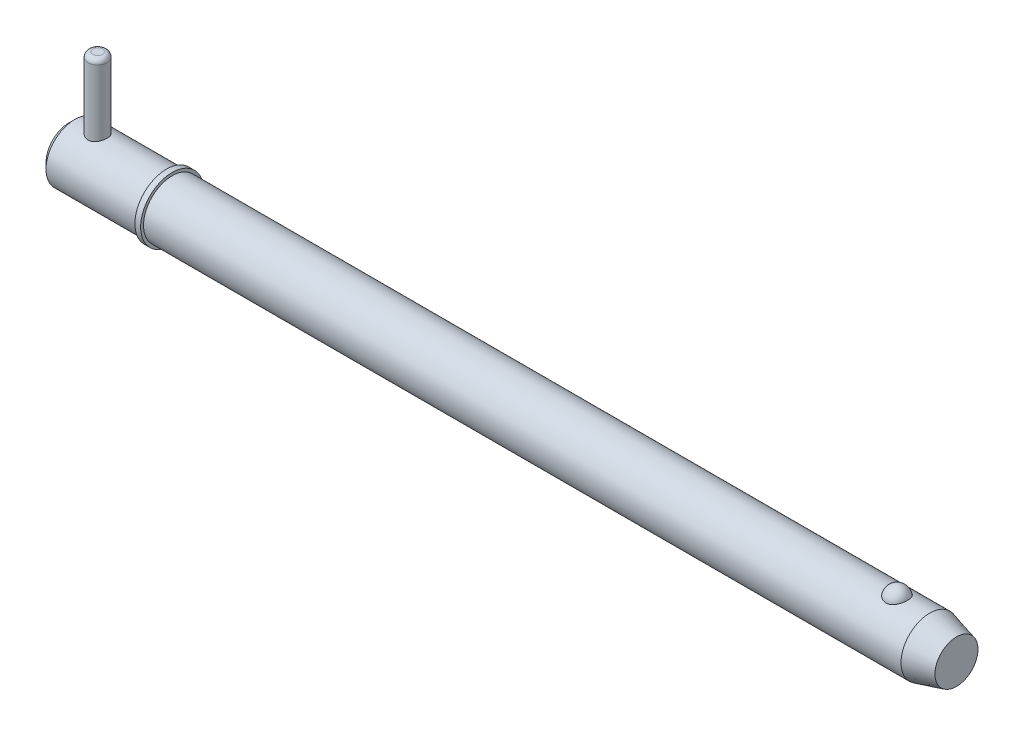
ISO-10303-21;
HEADER;
FILE_DESCRIPTION(('STEP AP214'),'2;1');
FILE_NAME('part.step','',(''),(''),'','','');
FILE_SCHEMA(('AUTOMOTIVE_DESIGN { 1 0 10303 214 1 1 1 1 }'));
ENDSEC;
DATA;
#1=APPLICATION_CONTEXT('core data for automotive mechanical design processes');
#2=APPLICATION_PROTOCOL_DEFINITION('international standard','automotive_design',2000,#1);
#3=PRODUCT_CONTEXT('',#1,'mechanical');
#4=PRODUCT('Part','Part','',(#3));
#5=PRODUCT_RELATED_PRODUCT_CATEGORY('part','',(#4));
#6=PRODUCT_DEFINITION_FORMATION('','',#4);
#7=PRODUCT_DEFINITION_CONTEXT('part definition',#1,'design');
#8=PRODUCT_DEFINITION('design','',#6,#7);
#9=PRODUCT_DEFINITION_SHAPE('','',#8);
#10=(LENGTH_UNIT() NAMED_UNIT(*) SI_UNIT(.MILLI.,.METRE.));
#11=(NAMED_UNIT(*) PLANE_ANGLE_UNIT() SI_UNIT($,.RADIAN.));
#12=(NAMED_UNIT(*) SI_UNIT($,.STERADIAN.) SOLID_ANGLE_UNIT());
#13=UNCERTAINTY_MEASURE_WITH_UNIT(LENGTH_MEASURE(1.E-05),#10,'distance_accuracy_value','');
#14=(GEOMETRIC_REPRESENTATION_CONTEXT(3) GLOBAL_UNCERTAINTY_ASSIGNED_CONTEXT((#13)) GLOBAL_UNIT_ASSIGNED_CONTEXT((#10,
#11,#12)) REPRESENTATION_CONTEXT('',''));
#15=CARTESIAN_POINT('',(0.,0.,0.));
#16=DIRECTION('',(0.,0.,1.));
#17=DIRECTION('',(1.,0.,0.));
#18=AXIS2_PLACEMENT_3D('',#15,#16,#17);
#19=CARTESIAN_POINT('',(7.14,24.605,0.));
#20=DIRECTION('',(0.,-1.,0.));
#21=DIRECTION('',(0.,0.,-1.));
#22=AXIS2_PLACEMENT_3D('',#19,#20,#21);
#23=CYLINDRICAL_SURFACE('',#22,2.38);
#24=CARTESIAN_POINT('',(7.14,-5.955,0.));
#25=DIRECTION('',(0.,1.,0.));
#26=DIRECTION('',(0.,0.,1.));
#27=AXIS2_PLACEMENT_3D('',#24,#25,#26);
#28=CIRCLE('',#27,2.38);
#29=CARTESIAN_POINT('',(7.14,-5.955,2.38));
#30=VERTEX_POINT('',#29);
#31=EDGE_CURVE('P0_E25',#30,#30,#28,.T.);
#32=ORIENTED_EDGE('',*,*,#31,.T.);
#33=EDGE_LOOP('',(#32));
#34=FACE_BOUND('',#33,.T.);
#35=CARTESIAN_POINT('',(7.14,23.415,0.));
#36=DIRECTION('',(0.,1.,0.));
#37=DIRECTION('',(0.,0.,1.));
#38=AXIS2_PLACEMENT_3D('',#35,#36,#37);
#39=CIRCLE('',#38,2.38);
#40=CARTESIAN_POINT('',(7.14,23.415,2.38));
#41=VERTEX_POINT('',#40);
#42=EDGE_CURVE('P0_E29',#41,#41,#39,.F.);
#43=ORIENTED_EDGE('',*,*,#42,.T.);
#44=EDGE_LOOP('',(#43));
#45=FACE_BOUND('',#44,.T.);
#46=ADVANCED_FACE('P0_F14',(#34,#45),#23,.T.);
#47=CARTESIAN_POINT('',(7.14,24.605,0.));
#48=DIRECTION('',(0.,1.,0.));
#49=DIRECTION('',(0.,0.,1.));
#50=AXIS2_PLACEMENT_3D('',#47,#48,#49);
#51=PLANE('',#50);
#52=CARTESIAN_POINT('',(7.14,24.605,0.));
#53=DIRECTION('',(0.,1.,0.));
#54=DIRECTION('',(0.,0.,1.));
#55=AXIS2_PLACEMENT_3D('',#52,#53,#54);
#56=CIRCLE('',#55,1.19);
#57=CARTESIAN_POINT('',(7.14,24.605,1.19));
#58=VERTEX_POINT('',#57);
#59=EDGE_CURVE('P0_E10',#58,#58,#56,.T.);
#60=ORIENTED_EDGE('',*,*,#59,.T.);
#61=EDGE_LOOP('',(#60));
#62=FACE_BOUND('',#61,.T.);
#63=ADVANCED_FACE('P0_F46',(#62),#51,.T.);
#64=CARTESIAN_POINT('',(7.14,-7.145,0.));
#65=DIRECTION('',(0.,1.,0.));
#66=DIRECTION('',(0.,0.,1.));
#67=AXIS2_PLACEMENT_3D('',#64,#65,#66);
#68=PLANE('',#67);
#69=CARTESIAN_POINT('',(7.14,-7.145,0.));
#70=DIRECTION('',(0.,1.,0.));
#71=DIRECTION('',(0.,0.,1.));
#72=AXIS2_PLACEMENT_3D('',#69,#70,#71);
#73=CIRCLE('',#72,1.19);
#74=CARTESIAN_POINT('',(7.14,-7.145,1.19));
#75=VERTEX_POINT('',#74);
#76=EDGE_CURVE('P0_E21',#75,#75,#73,.F.);
#77=ORIENTED_EDGE('',*,*,#76,.T.);
#78=EDGE_LOOP('',(#77));
#79=FACE_BOUND('',#78,.T.);
#80=ADVANCED_FACE('P0_F43',(#79),#68,.F.);
#81=CARTESIAN_POINT('',(7.14,-5.955,0.));
#82=DIRECTION('',(0.,1.,0.));
#83=DIRECTION('',(0.,0.,1.));
#84=AXIS2_PLACEMENT_3D('',#81,#82,#83);
#85=DEGENERATE_TOROIDAL_SURFACE('',#84,1.19,1.19,.T.);
#86=ORIENTED_EDGE('',*,*,#76,.F.);
#87=EDGE_LOOP('',(#86));
#88=FACE_BOUND('',#87,.T.);
#89=ORIENTED_EDGE('',*,*,#31,.F.);
#90=EDGE_LOOP('',(#89));
#91=FACE_BOUND('',#90,.T.);
#92=ADVANCED_FACE('P0_F38',(#88,#91),#85,.T.);
#93=CARTESIAN_POINT('',(7.14,23.415,0.));
#94=DIRECTION('',(0.,1.,0.));
#95=DIRECTION('',(0.,0.,1.));
#96=AXIS2_PLACEMENT_3D('',#93,#94,#95);
#97=DEGENERATE_TOROIDAL_SURFACE('',#96,1.19,1.19,.T.);
#98=ORIENTED_EDGE('',*,*,#42,.F.);
#99=EDGE_LOOP('',(#98));
#100=FACE_BOUND('',#99,.T.);
#101=ORIENTED_EDGE('',*,*,#59,.F.);
#102=EDGE_LOOP('',(#101));
#103=FACE_BOUND('',#102,.T.);
#104=ADVANCED_FACE('P0_F16',(#100,#103),#97,.T.);
#105=CLOSED_SHELL('',(#46,#63,#80,#92,#104));
#106=MANIFOLD_SOLID_BREP('P0_B1',#105);
#107=CARTESIAN_POINT('',(0.,0.,0.));
#108=DIRECTION('',(1.,0.,0.));
#109=DIRECTION('',(0.,0.,-1.));
#110=AXIS2_PLACEMENT_3D('',#107,#108,#109);
#111=CYLINDRICAL_SURFACE('',#110,7.145);
#112=CARTESIAN_POINT('',(214.28362424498,0.,0.));
#113=DIRECTION('',(1.,0.,0.));
#114=DIRECTION('',(0.,0.,-1.));
#115=AXIS2_PLACEMENT_3D('',#112,#113,#114);
#116=CIRCLE('',#115,7.145);
#117=CARTESIAN_POINT('',(214.28362424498,0.,-7.145));
#118=VERTEX_POINT('',#117);
#119=EDGE_CURVE('P1_E81',#118,#118,#116,.T.);
#120=ORIENTED_EDGE('',*,*,#119,.F.);
#121=EDGE_LOOP('',(#120));
#122=FACE_BOUND('',#121,.T.);
#123=CARTESIAN_POINT('',(25.7,0.,0.));
#124=DIRECTION('',(1.,0.,0.));
#125=DIRECTION('',(0.,0.,-1.));
#126=AXIS2_PLACEMENT_3D('',#123,#124,#125);
#127=CIRCLE('',#126,7.145);
#128=CARTESIAN_POINT('',(25.7,0.,-7.145));
#129=VERTEX_POINT('',#128);
#130=EDGE_CURVE('P1_E85',#129,#129,#127,.T.);
#131=ORIENTED_EDGE('',*,*,#130,.T.);
#132=EDGE_LOOP('',(#131));
#133=FACE_BOUND('',#132,.T.);
#134=CARTESIAN_POINT('',(206.139503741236,6.60328629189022,2.72903557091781));
#135=CARTESIAN_POINT('',(205.998315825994,6.60329644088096,2.72902496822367));
#136=CARTESIAN_POINT('',(205.856883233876,6.60799490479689,2.71772840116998));
#137=CARTESIAN_POINT('',(205.577955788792,6.62628236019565,2.67281935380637));
#138=CARTESIAN_POINT('',(205.440472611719,6.63989534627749,2.6391466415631));
#139=CARTESIAN_POINT('',(205.173889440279,6.67440775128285,2.55059642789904));
#140=CARTESIAN_POINT('',(205.044768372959,6.69528793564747,2.49577486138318));
#141=CARTESIAN_POINT('',(204.797869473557,6.74205585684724,2.36651799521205));
#142=CARTESIAN_POINT('',(204.680086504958,6.76794130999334,2.29209163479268));
#143=CARTESIAN_POINT('',(204.45516710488,6.82286177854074,2.12312937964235));
#144=CARTESIAN_POINT('',(204.348440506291,6.85196655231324,2.02807107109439));
#145=CARTESIAN_POINT('',(204.151918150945,6.90970232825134,1.82167822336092));
#146=CARTESIAN_POINT('',(204.062127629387,6.93833318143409,1.71033867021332));
#147=CARTESIAN_POINT('',(203.897667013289,6.9935167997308,1.46891951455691));
#148=CARTESIAN_POINT('',(203.823844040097,7.01992110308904,1.33822781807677));
#149=CARTESIAN_POINT('',(203.698088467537,7.06643385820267,1.06566567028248));
#150=CARTESIAN_POINT('',(203.64615735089,7.08654188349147,0.923794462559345));
#151=CARTESIAN_POINT('',(203.564732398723,7.11862399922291,0.630993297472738));
#152=CARTESIAN_POINT('',(203.535516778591,7.13049704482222,0.47997470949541));
#153=CARTESIAN_POINT('',(203.501174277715,7.14449484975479,0.174782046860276));
#154=CARTESIAN_POINT('',(203.496046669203,7.14661990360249,0.0206080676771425));
#155=CARTESIAN_POINT('',(203.509938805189,7.14092465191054,-0.285506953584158));
#156=CARTESIAN_POINT('',(203.528810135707,7.1331654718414,-0.437455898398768));
#157=CARTESIAN_POINT('',(203.590062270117,7.10859076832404,-0.735778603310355));
#158=CARTESIAN_POINT('',(203.632443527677,7.0917750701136,-0.882152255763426));
#159=CARTESIAN_POINT('',(203.739934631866,7.05076716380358,-1.165431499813));
#160=CARTESIAN_POINT('',(203.805075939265,7.02656475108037,-1.30232366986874));
#161=CARTESIAN_POINT('',(203.956759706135,6.97329145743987,-1.56265907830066));
#162=CARTESIAN_POINT('',(204.043303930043,6.94422017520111,-1.68610120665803));
#163=CARTESIAN_POINT('',(204.236465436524,6.88415108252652,-1.91671004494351));
#164=CARTESIAN_POINT('',(204.343180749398,6.85314438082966,-2.02379244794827));
#165=CARTESIAN_POINT('',(204.573974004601,6.79282069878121,-2.21787433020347));
#166=CARTESIAN_POINT('',(204.698050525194,6.76350358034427,-2.30487545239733));
#167=CARTESIAN_POINT('',(204.957678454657,6.71060580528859,-2.45458647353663));
#168=CARTESIAN_POINT('',(205.092938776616,6.68691885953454,-2.51776240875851));
#169=CARTESIAN_POINT('',(205.373277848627,6.64741247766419,-2.62030218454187));
#170=CARTESIAN_POINT('',(205.518352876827,6.63159007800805,-2.65967499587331));
#171=CARTESIAN_POINT('',(205.806347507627,6.61038594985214,-2.71193301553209));
#172=CARTESIAN_POINT('',(205.94900807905,6.60451880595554,-2.72605165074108));
#173=CARTESIAN_POINT('',(206.234800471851,6.60240611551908,-2.73116688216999));
#174=CARTESIAN_POINT('',(206.377932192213,6.60615862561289,-2.72216814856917));
#175=CARTESIAN_POINT('',(206.655848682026,6.62256094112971,-2.68200435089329));
#176=CARTESIAN_POINT('',(206.790754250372,6.63492533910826,-2.65154998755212));
#177=CARTESIAN_POINT('',(207.05332009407,6.66687445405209,-2.57015684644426));
#178=CARTESIAN_POINT('',(207.18097978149,6.68645975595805,-2.51921640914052));
#179=CARTESIAN_POINT('',(207.428577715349,6.73127274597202,-2.3969361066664));
#180=CARTESIAN_POINT('',(207.548287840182,6.75661381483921,-2.32517694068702));
#181=CARTESIAN_POINT('',(207.774159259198,6.81006003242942,-2.16363812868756));
#182=CARTESIAN_POINT('',(207.880317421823,6.83816581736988,-2.07385432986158));
#183=CARTESIAN_POINT('',(208.081862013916,6.8958046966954,-1.87357235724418));
#184=CARTESIAN_POINT('',(208.176440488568,6.92533863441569,-1.76226074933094));
#185=CARTESIAN_POINT('',(208.346332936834,6.981395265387,-1.52511696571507));
#186=CARTESIAN_POINT('',(208.421643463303,7.00791741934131,-1.39928219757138));
#187=CARTESIAN_POINT('',(208.553595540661,7.05607625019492,-1.13215977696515));
#188=CARTESIAN_POINT('',(208.609568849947,7.07753119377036,-0.990508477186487));
#189=CARTESIAN_POINT('',(208.698296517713,7.11222355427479,-0.699154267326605));
#190=CARTESIAN_POINT('',(208.731050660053,7.12546089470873,-0.549451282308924));
#191=CARTESIAN_POINT('',(208.772689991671,7.14237584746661,-0.246120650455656));
#192=CARTESIAN_POINT('',(208.781558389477,7.14604673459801,-0.0924903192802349));
#193=CARTESIAN_POINT('',(208.775194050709,7.14343510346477,0.214181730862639));
#194=CARTESIAN_POINT('',(208.759961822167,7.13715279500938,0.367223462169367));
#195=CARTESIAN_POINT('',(208.705845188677,7.1153294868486,0.667595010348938));
#196=CARTESIAN_POINT('',(208.667077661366,7.09983424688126,0.814949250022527));
#197=CARTESIAN_POINT('',(208.566770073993,7.06119140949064,1.10063221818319));
#198=CARTESIAN_POINT('',(208.505228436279,7.03804328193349,1.238960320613));
#199=CARTESIAN_POINT('',(208.360207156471,6.98632429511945,1.50352300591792));
#200=CARTESIAN_POINT('',(208.276606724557,6.95772382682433,1.62968561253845));
#201=CARTESIAN_POINT('',(208.08938046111,6.89823072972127,1.86554304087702));
#202=CARTESIAN_POINT('',(207.985755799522,6.86733823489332,1.97523882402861));
#203=CARTESIAN_POINT('',(207.761076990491,6.80676456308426,2.17482293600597));
#204=CARTESIAN_POINT('',(207.640067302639,6.77708053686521,2.2647603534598));
#205=CARTESIAN_POINT('',(207.383340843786,6.72230501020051,2.42252989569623));
#206=CARTESIAN_POINT('',(207.24761851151,6.69721525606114,2.49035362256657));
#207=CARTESIAN_POINT('',(206.970402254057,6.65552591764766,2.59967646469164));
#208=CARTESIAN_POINT('',(206.829281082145,6.63865794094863,2.64202017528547));
#209=CARTESIAN_POINT('',(206.541444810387,6.61425039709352,2.70255841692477));
#210=CARTESIAN_POINT('',(206.394748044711,6.60668259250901,2.72082606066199));
#211=CARTESIAN_POINT('',(206.211679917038,6.60358754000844,2.72830331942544));
#212=CARTESIAN_POINT('',(206.175599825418,6.60328369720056,2.72903828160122));
#213=CARTESIAN_POINT('',(206.139503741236,6.60328629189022,2.72903557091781));
#214=B_SPLINE_CURVE_WITH_KNOTS('',3,(#134,#135,#136,#137,#138,#139,#140,#141,#142,#143,#144,
#145,#146,#147,#148,#149,#150,#151,#152,#153,#154,#155,#156,#157,#158,#159,#160,#161,#162,#163,
#164,#165,#166,#167,#168,#169,#170,#171,#172,#173,#174,#175,#176,#177,#178,#179,#180,#181,#182,
#183,#184,#185,#186,#187,#188,#189,#190,#191,#192,#193,#194,#195,#196,#197,#198,#199,#200,#201,
#202,#203,#204,#205,#206,#207,#208,#209,#210,#211,#212,#213),.UNSPECIFIED.,.T.,.F.,(4,2,2,2,2,2,
2,2,2,2,2,2,2,2,2,2,2,2,2,2,2,2,2,2,2,2,2,2,2,2,2,2,2,2,2,2,2,2,2,4),(0.,0.423468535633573,
0.848081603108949,1.27157926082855,1.69488414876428,2.13051395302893,2.56627819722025,
3.0213670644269,3.47648674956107,3.93709649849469,4.39769233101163,4.85545355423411,
5.31322361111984,5.77162895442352,6.23007210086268,6.69080337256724,7.15149693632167,
7.60264329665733,8.05361952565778,8.48189729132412,8.91008854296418,9.32472524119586,
9.73939553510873,10.1630783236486,10.5868588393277,11.0319070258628,11.4770347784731,
11.9362874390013,12.3955443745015,12.855124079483,13.3146940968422,13.7720003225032,
14.2293382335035,14.6892343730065,15.1491036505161,15.6078171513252,16.0667046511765,
16.5093965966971,16.9507410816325,17.0590049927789),.UNSPECIFIED.);
#215=CARTESIAN_POINT('',(206.139503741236,6.60328629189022,2.72903557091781));
#216=VERTEX_POINT('',#215);
#217=EDGE_CURVE('P1_E35',#216,#216,#214,.T.);
#218=ORIENTED_EDGE('',*,*,#217,.T.);
#219=EDGE_LOOP('',(#218));
#220=FACE_BOUND('',#219,.T.);
#221=ADVANCED_FACE('P1_F13',(#122,#133,#220),#111,.T.);
#222=CARTESIAN_POINT('',(0.,0.,0.));
#223=DIRECTION('',(-1.,0.,0.));
#224=DIRECTION('',(0.,0.,1.));
#225=AXIS2_PLACEMENT_3D('',#222,#223,#224);
#226=PLANE('',#225);
#227=CARTESIAN_POINT('',(0.,0.,0.));
#228=DIRECTION('',(1.,0.,0.));
#229=DIRECTION('',(0.,0.,-1.));
#230=AXIS2_PLACEMENT_3D('',#227,#228,#229);
#231=CIRCLE('',#230,5.716);
#232=CARTESIAN_POINT('',(0.,0.,-5.716));
#233=VERTEX_POINT('',#232);
#234=EDGE_CURVE('P1_E9',#233,#233,#231,.T.);
#235=ORIENTED_EDGE('',*,*,#234,.F.);
#236=EDGE_LOOP('',(#235));
#237=FACE_BOUND('',#236,.T.);
#238=ADVANCED_FACE('P1_F15',(#237),#226,.T.);
#239=CARTESIAN_POINT('',(1.42899999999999,0.,0.));
#240=DIRECTION('',(1.,0.,0.));
#241=DIRECTION('',(0.,0.,-1.));
#242=AXIS2_PLACEMENT_3D('',#239,#240,#241);
#243=CONICAL_SURFACE('',#242,7.145,0.78539816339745);
#244=ORIENTED_EDGE('',*,*,#234,.T.);
#245=EDGE_LOOP('',(#244));
#246=FACE_BOUND('',#245,.T.);
#247=CARTESIAN_POINT('',(1.42899999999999,0.,0.));
#248=DIRECTION('',(1.,0.,0.));
#249=DIRECTION('',(0.,0.,-1.));
#250=AXIS2_PLACEMENT_3D('',#247,#248,#249);
#251=CIRCLE('',#250,7.145);
#252=CARTESIAN_POINT('',(1.42899999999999,0.,-7.145));
#253=VERTEX_POINT('',#252);
#254=EDGE_CURVE('P1_E26',#253,#253,#251,.T.);
#255=ORIENTED_EDGE('',*,*,#254,.F.);
#256=EDGE_LOOP('',(#255));
#257=FACE_BOUND('',#256,.T.);
#258=ADVANCED_FACE('P1_F77',(#246,#257),#243,.T.);
#259=CARTESIAN_POINT('',(0.,0.,0.));
#260=DIRECTION('',(1.,0.,0.));
#261=DIRECTION('',(0.,0.,-1.));
#262=AXIS2_PLACEMENT_3D('',#259,#260,#261);
#263=CYLINDRICAL_SURFACE('',#262,7.145);
#264=CARTESIAN_POINT('',(7.14,-6.73695962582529,2.38));
#265=CARTESIAN_POINT('',(7.01035997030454,-6.73695921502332,2.38000059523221));
#266=CARTESIAN_POINT('',(6.88072348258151,-6.74074253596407,2.36937183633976));
#267=CARTESIAN_POINT('',(6.62529075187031,-6.75538853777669,2.32728080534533));
#268=CARTESIAN_POINT('',(6.49949514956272,-6.76625239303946,2.29581507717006));
#269=CARTESIAN_POINT('',(6.2554858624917,-6.79369535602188,2.21327763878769));
#270=CARTESIAN_POINT('',(6.13725786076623,-6.81026326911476,2.16224430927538));
#271=CARTESIAN_POINT('',(5.91100349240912,-6.84723128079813,2.04215132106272));
#272=CARTESIAN_POINT('',(5.80297937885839,-6.86763222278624,1.97308769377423));
#273=CARTESIAN_POINT('',(5.59597854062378,-6.91086152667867,1.81600414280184));
#274=CARTESIAN_POINT('',(5.49745861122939,-6.93375032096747,1.72739874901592));
#275=CARTESIAN_POINT('',(5.31636508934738,-6.97886546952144,1.53499636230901));
#276=CARTESIAN_POINT('',(5.23379405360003,-7.00109171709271,1.43119693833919));
#277=CARTESIAN_POINT('',(5.08487013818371,-7.04307708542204,1.20801318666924));
#278=CARTESIAN_POINT('',(5.01899578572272,-7.06275685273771,1.08829330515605));
#279=CARTESIAN_POINT('',(4.90850130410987,-7.09671988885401,0.838703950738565));
#280=CARTESIAN_POINT('',(4.86387545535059,-7.11100460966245,0.70883722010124));
#281=CARTESIAN_POINT('',(4.79869354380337,-7.13213998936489,0.44742990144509));
#282=CARTESIAN_POINT('',(4.77735497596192,-7.13923172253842,0.316104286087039));
#283=CARTESIAN_POINT('',(4.75686536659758,-7.14603777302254,0.0515578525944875));
#284=CARTESIAN_POINT('',(4.75770861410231,-7.14575398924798,-0.0816624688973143));
#285=CARTESIAN_POINT('',(4.78106216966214,-7.13800438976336,-0.340678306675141));
#286=CARTESIAN_POINT('',(4.80272255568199,-7.13082030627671,-0.466560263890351));
#287=CARTESIAN_POINT('',(4.86569013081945,-7.11043095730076,-0.712788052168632));
#288=CARTESIAN_POINT('',(4.90699865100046,-7.09722528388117,-0.833133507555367));
#289=CARTESIAN_POINT('',(5.00858673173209,-7.06591754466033,-1.06673173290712));
#290=CARTESIAN_POINT('',(5.06910834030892,-7.0477534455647,-1.17987058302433));
#291=CARTESIAN_POINT('',(5.20720514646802,-7.00841977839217,-1.39463797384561));
#292=CARTESIAN_POINT('',(5.28478508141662,-6.987249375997,-1.49626330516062));
#293=CARTESIAN_POINT('',(5.4590800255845,-6.94296010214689,-1.69017445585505));
#294=CARTESIAN_POINT('',(5.55652324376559,-6.91979641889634,-1.78179645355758));
#295=CARTESIAN_POINT('',(5.76558873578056,-6.87497076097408,-1.94761348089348));
#296=CARTESIAN_POINT('',(5.87721318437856,-6.85330901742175,-2.02180583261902));
#297=CARTESIAN_POINT('',(6.11357367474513,-6.81369485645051,-2.15157488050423));
#298=CARTESIAN_POINT('',(6.23847358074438,-6.79579956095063,-2.20687188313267));
#299=CARTESIAN_POINT('',(6.49655785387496,-6.76640630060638,-2.29542443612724));
#300=CARTESIAN_POINT('',(6.62973872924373,-6.75490565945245,-2.32868920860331));
#301=CARTESIAN_POINT('',(6.89417536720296,-6.74020933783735,-2.37088225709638));
#302=CARTESIAN_POINT('',(7.02524746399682,-6.73666278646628,-2.38083959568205));
#303=CARTESIAN_POINT('',(7.28721035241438,-6.73729555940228,-2.37904974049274));
#304=CARTESIAN_POINT('',(7.41810117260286,-6.7414734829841,-2.36730648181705));
#305=CARTESIAN_POINT('',(7.67130717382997,-6.75673471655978,-2.32337336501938));
#306=CARTESIAN_POINT('',(7.79376251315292,-6.76757635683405,-2.29189834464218));
#307=CARTESIAN_POINT('',(8.03162917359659,-6.79467771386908,-2.21025275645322));
#308=CARTESIAN_POINT('',(8.14703924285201,-6.8109383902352,-2.16007887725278));
#309=CARTESIAN_POINT('',(8.37159169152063,-6.84768362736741,-2.04065289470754));
#310=CARTESIAN_POINT('',(8.48041962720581,-6.86828569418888,-1.97084668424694));
#311=CARTESIAN_POINT('',(8.68518919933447,-6.91116416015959,-1.8147657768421));
#312=CARTESIAN_POINT('',(8.78112702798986,-6.93344105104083,-1.72848623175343));
#313=CARTESIAN_POINT('',(8.96215574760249,-6.97845348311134,-1.53698616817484));
#314=CARTESIAN_POINT('',(9.04650427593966,-7.00115965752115,-1.43105491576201));
#315=CARTESIAN_POINT('',(9.19627592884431,-7.04341676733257,-1.20598377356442));
#316=CARTESIAN_POINT('',(9.26169972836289,-7.06296781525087,-1.08684435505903));
#317=CARTESIAN_POINT('',(9.37116617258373,-7.0966205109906,-0.83933303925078));
#318=CARTESIAN_POINT('',(9.41534821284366,-7.11075755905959,-0.711027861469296));
#319=CARTESIAN_POINT('',(9.48132660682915,-7.13214194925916,-0.448245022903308));
#320=CARTESIAN_POINT('',(9.50313102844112,-7.13939177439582,-0.313769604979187));
#321=CARTESIAN_POINT('',(9.5230098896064,-7.14599771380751,-0.049254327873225));
#322=CARTESIAN_POINT('',(9.52215013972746,-7.14570837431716,0.0806974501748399));
#323=CARTESIAN_POINT('',(9.49935359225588,-7.13814116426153,0.338518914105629));
#324=CARTESIAN_POINT('',(9.47741850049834,-7.13086385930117,0.466388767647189));
#325=CARTESIAN_POINT('',(9.4138005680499,-7.11026814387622,0.714400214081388));
#326=CARTESIAN_POINT('',(9.37243609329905,-7.09704726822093,0.834632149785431));
#327=CARTESIAN_POINT('',(9.27142829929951,-7.06592602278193,1.06649582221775));
#328=CARTESIAN_POINT('',(9.2117816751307,-7.04802480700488,1.1781259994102));
#329=CARTESIAN_POINT('',(9.07336776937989,-7.00856499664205,1.39411030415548));
#330=CARTESIAN_POINT('',(8.99397590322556,-6.98689577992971,1.49804368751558));
#331=CARTESIAN_POINT('',(8.81938810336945,-6.9426110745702,1.69146078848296));
#332=CARTESIAN_POINT('',(8.72418713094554,-6.91999528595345,1.78093988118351));
#333=CARTESIAN_POINT('',(8.51623540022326,-6.87531507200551,1.94646188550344));
#334=CARTESIAN_POINT('',(8.4029442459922,-6.85330672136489,2.02184316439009));
#335=CARTESIAN_POINT('',(8.16461714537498,-6.81342065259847,2.1524427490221));
#336=CARTESIAN_POINT('',(8.03958429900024,-6.7955418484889,2.20766635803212));
#337=CARTESIAN_POINT('',(7.78712566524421,-6.76686117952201,2.29403636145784));
#338=CARTESIAN_POINT('',(7.66006989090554,-6.75577342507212,2.32616709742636));
#339=CARTESIAN_POINT('',(7.40200728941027,-6.74082409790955,2.36914495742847));
#340=CARTESIAN_POINT('',(7.27100183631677,-6.73696004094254,2.37999939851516));
#341=CARTESIAN_POINT('',(7.14,-6.73695962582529,2.38));
#342=B_SPLINE_CURVE_WITH_KNOTS('',3,(#264,#265,#266,#267,#268,#269,#270,#271,#272,#273,#274,
#275,#276,#277,#278,#279,#280,#281,#282,#283,#284,#285,#286,#287,#288,#289,#290,#291,#292,#293,
#294,#295,#296,#297,#298,#299,#300,#301,#302,#303,#304,#305,#306,#307,#308,#309,#310,#311,#312,
#313,#314,#315,#316,#317,#318,#319,#320,#321,#322,#323,#324,#325,#326,#327,#328,#329,#330,#331,
#332,#333,#334,#335,#336,#337,#338,#339,#340,#341),.UNSPECIFIED.,.T.,.F.,(4,2,2,2,2,2,2,2,2,2,2,
2,2,2,2,2,2,2,2,2,2,2,2,2,2,2,2,2,2,2,2,2,2,2,2,2,2,2,4),(0.,0.388434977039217,
0.776934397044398,1.16467566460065,1.55250234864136,1.9540847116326,2.35573139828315,
2.76784120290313,3.17984001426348,3.57752248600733,3.97510257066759,4.35711073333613,
4.7391447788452,5.12619663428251,5.51335611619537,5.91871976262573,6.3241456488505,
6.73533623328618,7.14635459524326,7.53885245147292,7.93127914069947,8.31025106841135,
8.68929014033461,9.08033871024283,9.47150254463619,9.88145528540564,10.2913934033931,
10.6986033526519,11.1056664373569,11.4936225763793,11.8815473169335,12.2633262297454,
12.645174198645,13.0411187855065,13.437189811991,13.8487371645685,14.2601761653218,
14.6528265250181,15.0453418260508),.UNSPECIFIED.);
#343=CARTESIAN_POINT('',(7.14,-6.73695962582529,2.38));
#344=VERTEX_POINT('',#343);
#345=EDGE_CURVE('P1_E17',#344,#344,#342,.T.);
#346=ORIENTED_EDGE('',*,*,#345,.F.);
#347=EDGE_LOOP('',(#346));
#348=FACE_BOUND('',#347,.T.);
#349=CARTESIAN_POINT('',(7.14,6.73695962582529,2.38));
#350=CARTESIAN_POINT('',(7.26964002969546,6.73695921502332,2.38000059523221));
#351=CARTESIAN_POINT('',(7.39927651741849,6.74074253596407,2.36937183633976));
#352=CARTESIAN_POINT('',(7.65470924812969,6.75538853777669,2.32728080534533));
#353=CARTESIAN_POINT('',(7.78050485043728,6.76625239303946,2.29581507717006));
#354=CARTESIAN_POINT('',(8.02451413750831,6.79369535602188,2.21327763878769));
#355=CARTESIAN_POINT('',(8.14274213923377,6.81026326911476,2.16224430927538));
#356=CARTESIAN_POINT('',(8.36899650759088,6.84723128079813,2.04215132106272));
#357=CARTESIAN_POINT('',(8.47702062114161,6.86763222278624,1.97308769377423));
#358=CARTESIAN_POINT('',(8.68402145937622,6.91086152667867,1.81600414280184));
#359=CARTESIAN_POINT('',(8.78254138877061,6.93375032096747,1.72739874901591));
#360=CARTESIAN_POINT('',(8.96363491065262,6.97886546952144,1.53499636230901));
#361=CARTESIAN_POINT('',(9.04620594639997,7.00109171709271,1.43119693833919));
#362=CARTESIAN_POINT('',(9.19512986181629,7.04307708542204,1.20801318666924));
#363=CARTESIAN_POINT('',(9.26100421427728,7.06275685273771,1.08829330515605));
#364=CARTESIAN_POINT('',(9.37149869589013,7.09671988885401,0.838703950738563));
#365=CARTESIAN_POINT('',(9.41612454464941,7.11100460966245,0.708837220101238));
#366=CARTESIAN_POINT('',(9.48130645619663,7.13213998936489,0.447429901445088));
#367=CARTESIAN_POINT('',(9.50264502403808,7.13923172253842,0.316104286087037));
#368=CARTESIAN_POINT('',(9.52313463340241,7.14603777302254,0.0515578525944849));
#369=CARTESIAN_POINT('',(9.52229138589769,7.14575398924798,-0.0816624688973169));
#370=CARTESIAN_POINT('',(9.49893783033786,7.13800438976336,-0.340678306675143));
#371=CARTESIAN_POINT('',(9.47727744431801,7.13082030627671,-0.466560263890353));
#372=CARTESIAN_POINT('',(9.41430986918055,7.11043095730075,-0.712788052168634));
#373=CARTESIAN_POINT('',(9.37300134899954,7.09722528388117,-0.833133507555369));
#374=CARTESIAN_POINT('',(9.27141326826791,7.06591754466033,-1.06673173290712));
#375=CARTESIAN_POINT('',(9.21089165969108,7.0477534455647,-1.17987058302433));
#376=CARTESIAN_POINT('',(9.07279485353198,7.00841977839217,-1.39463797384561));
#377=CARTESIAN_POINT('',(8.99521491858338,6.987249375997,-1.49626330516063));
#378=CARTESIAN_POINT('',(8.82091997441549,6.94296010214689,-1.69017445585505));
#379=CARTESIAN_POINT('',(8.72347675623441,6.91979641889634,-1.78179645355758));
#380=CARTESIAN_POINT('',(8.51441126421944,6.87497076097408,-1.94761348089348));
#381=CARTESIAN_POINT('',(8.40278681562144,6.85330901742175,-2.02180583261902));
#382=CARTESIAN_POINT('',(8.16642632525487,6.81369485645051,-2.15157488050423));
#383=CARTESIAN_POINT('',(8.04152641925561,6.79579956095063,-2.20687188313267));
#384=CARTESIAN_POINT('',(7.78344214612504,6.76640630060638,-2.29542443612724));
#385=CARTESIAN_POINT('',(7.65026127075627,6.75490565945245,-2.32868920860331));
#386=CARTESIAN_POINT('',(7.38582463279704,6.74020933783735,-2.37088225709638));
#387=CARTESIAN_POINT('',(7.25475253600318,6.73666278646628,-2.38083959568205));
#388=CARTESIAN_POINT('',(6.99278964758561,6.73729555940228,-2.37904974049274));
#389=CARTESIAN_POINT('',(6.86189882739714,6.7414734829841,-2.36730648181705));
#390=CARTESIAN_POINT('',(6.60869282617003,6.75673471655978,-2.32337336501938));
#391=CARTESIAN_POINT('',(6.48623748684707,6.76757635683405,-2.29189834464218));
#392=CARTESIAN_POINT('',(6.2483708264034,6.79467771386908,-2.21025275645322));
#393=CARTESIAN_POINT('',(6.13296075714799,6.8109383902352,-2.16007887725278));
#394=CARTESIAN_POINT('',(5.90840830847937,6.84768362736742,-2.04065289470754));
#395=CARTESIAN_POINT('',(5.79958037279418,6.86828569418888,-1.97084668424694));
#396=CARTESIAN_POINT('',(5.59481080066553,6.91116416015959,-1.8147657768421));
#397=CARTESIAN_POINT('',(5.49887297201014,6.93344105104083,-1.72848623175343));
#398=CARTESIAN_POINT('',(5.31784425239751,6.97845348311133,-1.53698616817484));
#399=CARTESIAN_POINT('',(5.23349572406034,7.00115965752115,-1.43105491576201));
#400=CARTESIAN_POINT('',(5.08372407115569,7.04341676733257,-1.20598377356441));
#401=CARTESIAN_POINT('',(5.01830027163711,7.06296781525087,-1.08684435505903));
#402=CARTESIAN_POINT('',(4.90883382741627,7.0966205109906,-0.839333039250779));
#403=CARTESIAN_POINT('',(4.86465178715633,7.11075755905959,-0.711027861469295));
#404=CARTESIAN_POINT('',(4.79867339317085,7.13214194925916,-0.448245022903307));
#405=CARTESIAN_POINT('',(4.77686897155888,7.13939177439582,-0.313769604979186));
#406=CARTESIAN_POINT('',(4.7569901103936,7.14599771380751,-0.0492543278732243));
#407=CARTESIAN_POINT('',(4.75784986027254,7.14570837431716,0.0806974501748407));
#408=CARTESIAN_POINT('',(4.78064640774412,7.13814116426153,0.33851891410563));
#409=CARTESIAN_POINT('',(4.80258149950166,7.13086385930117,0.46638876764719));
#410=CARTESIAN_POINT('',(4.8661994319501,7.11026814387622,0.714400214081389));
#411=CARTESIAN_POINT('',(4.90756390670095,7.09704726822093,0.834632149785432));
#412=CARTESIAN_POINT('',(5.00857170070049,7.06592602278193,1.06649582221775));
#413=CARTESIAN_POINT('',(5.0682183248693,7.04802480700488,1.1781259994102));
#414=CARTESIAN_POINT('',(5.20663223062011,7.00856499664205,1.39411030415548));
#415=CARTESIAN_POINT('',(5.28602409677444,6.98689577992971,1.49804368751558));
#416=CARTESIAN_POINT('',(5.46061189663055,6.9426110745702,1.69146078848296));
#417=CARTESIAN_POINT('',(5.55581286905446,6.91999528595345,1.78093988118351));
#418=CARTESIAN_POINT('',(5.76376459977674,6.87531507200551,1.94646188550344));
#419=CARTESIAN_POINT('',(5.8770557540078,6.85330672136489,2.02184316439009));
#420=CARTESIAN_POINT('',(6.11538285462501,6.81342065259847,2.1524427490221));
#421=CARTESIAN_POINT('',(6.24041570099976,6.7955418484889,2.20766635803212));
#422=CARTESIAN_POINT('',(6.4928743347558,6.76686117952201,2.29403636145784));
#423=CARTESIAN_POINT('',(6.61993010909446,6.75577342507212,2.32616709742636));
#424=CARTESIAN_POINT('',(6.87799271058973,6.74082409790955,2.36914495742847));
#425=CARTESIAN_POINT('',(7.00899816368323,6.73696004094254,2.37999939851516));
#426=CARTESIAN_POINT('',(7.14,6.73695962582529,2.38));
#427=B_SPLINE_CURVE_WITH_KNOTS('',3,(#349,#350,#351,#352,#353,#354,#355,#356,#357,#358,#359,
#360,#361,#362,#363,#364,#365,#366,#367,#368,#369,#370,#371,#372,#373,#374,#375,#376,#377,#378,
#379,#380,#381,#382,#383,#384,#385,#386,#387,#388,#389,#390,#391,#392,#393,#394,#395,#396,#397,
#398,#399,#400,#401,#402,#403,#404,#405,#406,#407,#408,#409,#410,#411,#412,#413,#414,#415,#416,
#417,#418,#419,#420,#421,#422,#423,#424,#425,#426),.UNSPECIFIED.,.T.,.F.,(4,2,2,2,2,2,2,2,2,2,2,
2,2,2,2,2,2,2,2,2,2,2,2,2,2,2,2,2,2,2,2,2,2,2,2,2,2,2,4),(0.,0.388434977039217,
0.776934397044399,1.16467566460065,1.55250234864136,1.9540847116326,2.35573139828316,
2.76784120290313,3.17984001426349,3.57752248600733,3.97510257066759,4.35711073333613,
4.73914477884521,5.12619663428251,5.51335611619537,5.91871976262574,6.3241456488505,
6.73533623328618,7.14635459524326,7.53885245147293,7.93127914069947,8.31025106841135,
8.68929014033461,9.08033871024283,9.47150254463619,9.88145528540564,10.2913934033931,
10.6986033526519,11.1056664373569,11.4936225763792,11.8815473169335,12.2633262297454,
12.645174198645,13.0411187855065,13.437189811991,13.8487371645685,14.2601761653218,
14.6528265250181,15.0453418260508),.UNSPECIFIED.);
#428=CARTESIAN_POINT('',(7.14,6.73695962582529,2.38));
#429=VERTEX_POINT('',#428);
#430=EDGE_CURVE('P1_E43',#429,#429,#427,.T.);
#431=ORIENTED_EDGE('',*,*,#430,.F.);
#432=EDGE_LOOP('',(#431));
#433=FACE_BOUND('',#432,.T.);
#434=ORIENTED_EDGE('',*,*,#254,.T.);
#435=EDGE_LOOP('',(#434));
#436=FACE_BOUND('',#435,.T.);
#437=CARTESIAN_POINT('',(24.271,0.,0.));
#438=DIRECTION('',(1.,0.,0.));
#439=DIRECTION('',(0.,0.,-1.));
#440=AXIS2_PLACEMENT_3D('',#437,#438,#439);
#441=CIRCLE('',#440,7.145);
#442=CARTESIAN_POINT('',(24.271,0.,-7.145));
#443=VERTEX_POINT('',#442);
#444=EDGE_CURVE('P1_E31',#443,#443,#441,.T.);
#445=ORIENTED_EDGE('',*,*,#444,.F.);
#446=EDGE_LOOP('',(#445));
#447=FACE_BOUND('',#446,.T.);
#448=ADVANCED_FACE('P1_F103',(#348,#433,#436,#447),#263,.T.);
#449=CARTESIAN_POINT('',(24.271,7.145,0.));
#450=DIRECTION('',(-1.,0.,0.));
#451=DIRECTION('',(0.,0.,1.));
#452=AXIS2_PLACEMENT_3D('',#449,#450,#451);
#453=PLANE('',#452);
#454=ORIENTED_EDGE('',*,*,#444,.T.);
#455=EDGE_LOOP('',(#454));
#456=FACE_BOUND('',#455,.T.);
#457=CARTESIAN_POINT('',(24.271,0.,0.));
#458=DIRECTION('',(1.,0.,0.));
#459=DIRECTION('',(0.,0.,-1.));
#460=AXIS2_PLACEMENT_3D('',#457,#458,#459);
#461=CIRCLE('',#460,7.8595);
#462=CARTESIAN_POINT('',(24.271,0.,-7.8595));
#463=VERTEX_POINT('',#462);
#464=EDGE_CURVE('P1_E91',#463,#463,#461,.T.);
#465=ORIENTED_EDGE('',*,*,#464,.F.);
#466=EDGE_LOOP('',(#465));
#467=FACE_BOUND('',#466,.T.);
#468=ADVANCED_FACE('P1_F100',(#456,#467),#453,.T.);
#469=CARTESIAN_POINT('',(0.,0.,0.));
#470=DIRECTION('',(1.,0.,0.));
#471=DIRECTION('',(0.,0.,-1.));
#472=AXIS2_PLACEMENT_3D('',#469,#470,#471);
#473=CYLINDRICAL_SURFACE('',#472,7.8595);
#474=ORIENTED_EDGE('',*,*,#464,.T.);
#475=EDGE_LOOP('',(#474));
#476=FACE_BOUND('',#475,.T.);
#477=CARTESIAN_POINT('',(25.7,0.,0.));
#478=DIRECTION('',(1.,0.,0.));
#479=DIRECTION('',(0.,0.,-1.));
#480=AXIS2_PLACEMENT_3D('',#477,#478,#479);
#481=CIRCLE('',#480,7.8595);
#482=CARTESIAN_POINT('',(25.7,0.,-7.8595));
#483=VERTEX_POINT('',#482);
#484=EDGE_CURVE('P1_E88',#483,#483,#481,.T.);
#485=ORIENTED_EDGE('',*,*,#484,.F.);
#486=EDGE_LOOP('',(#485));
#487=FACE_BOUND('',#486,.T.);
#488=ADVANCED_FACE('P1_F68',(#476,#487),#473,.T.);
#489=CARTESIAN_POINT('',(25.7,7.8595,0.));
#490=DIRECTION('',(1.,0.,0.));
#491=DIRECTION('',(0.,0.,-1.));
#492=AXIS2_PLACEMENT_3D('',#489,#490,#491);
#493=PLANE('',#492);
#494=ORIENTED_EDGE('',*,*,#484,.T.);
#495=EDGE_LOOP('',(#494));
#496=FACE_BOUND('',#495,.T.);
#497=ORIENTED_EDGE('',*,*,#130,.F.);
#498=EDGE_LOOP('',(#497));
#499=FACE_BOUND('',#498,.T.);
#500=ADVANCED_FACE('P1_F62',(#496,#499),#493,.T.);
#501=CARTESIAN_POINT('',(220.95,0.,0.));
#502=DIRECTION('',(-1.,0.,0.));
#503=DIRECTION('',(0.,0.,1.));
#504=AXIS2_PLACEMENT_3D('',#501,#502,#503);
#505=CONICAL_SURFACE('',#504,5.35875000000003,0.26179938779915);
#506=ORIENTED_EDGE('',*,*,#119,.T.);
#507=EDGE_LOOP('',(#506));
#508=FACE_BOUND('',#507,.T.);
#509=CARTESIAN_POINT('',(220.95,0.,0.));
#510=DIRECTION('',(1.,0.,0.));
#511=DIRECTION('',(0.,0.,-1.));
#512=AXIS2_PLACEMENT_3D('',#509,#510,#511);
#513=CIRCLE('',#512,5.35875000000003);
#514=CARTESIAN_POINT('',(220.95,0.,-5.35875000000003));
#515=VERTEX_POINT('',#514);
#516=EDGE_CURVE('P1_E42',#515,#515,#513,.T.);
#517=ORIENTED_EDGE('',*,*,#516,.F.);
#518=EDGE_LOOP('',(#517));
#519=FACE_BOUND('',#518,.T.);
#520=ADVANCED_FACE('P1_F59',(#508,#519),#505,.T.);
#521=CARTESIAN_POINT('',(220.95,5.35875000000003,0.));
#522=DIRECTION('',(1.,0.,0.));
#523=DIRECTION('',(0.,0.,-1.));
#524=AXIS2_PLACEMENT_3D('',#521,#522,#523);
#525=PLANE('',#524);
#526=ORIENTED_EDGE('',*,*,#516,.T.);
#527=EDGE_LOOP('',(#526));
#528=FACE_BOUND('',#527,.T.);
#529=ADVANCED_FACE('P1_F55',(#528),#525,.T.);
#530=CARTESIAN_POINT('',(206.139503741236,6.4305,0.));
#531=DIRECTION('',(-1.,0.,0.));
#532=DIRECTION('',(0.,-1.,0.));
#533=AXIS2_PLACEMENT_3D('',#530,#531,#532);
#534=SPHERICAL_SURFACE('',#533,2.73449999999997);
#535=ORIENTED_EDGE('',*,*,#217,.F.);
#536=EDGE_LOOP('',(#535));
#537=FACE_BOUND('',#536,.T.);
#538=ADVANCED_FACE('P1_F50',(#537),#534,.T.);
#539=CARTESIAN_POINT('',(7.14,-7.8595,0.));
#540=DIRECTION('',(0.,1.,0.));
#541=DIRECTION('',(0.,0.,1.));
#542=AXIS2_PLACEMENT_3D('',#539,#540,#541);
#543=CYLINDRICAL_SURFACE('',#542,2.38);
#544=ORIENTED_EDGE('',*,*,#345,.T.);
#545=EDGE_LOOP('',(#544));
#546=FACE_BOUND('',#545,.T.);
#547=ORIENTED_EDGE('',*,*,#430,.T.);
#548=EDGE_LOOP('',(#547));
#549=FACE_BOUND('',#548,.T.);
#550=ADVANCED_FACE('P1_F54',(#546,#549),#543,.F.);
#551=CLOSED_SHELL('',(#221,#238,#258,#448,#468,#488,#500,#520,#529,#538,#550));
#552=MANIFOLD_SOLID_BREP('P1_B1',#551);
#553=ADVANCED_BREP_SHAPE_REPRESENTATION('',(#18,#106,#552),#14);
#554=SHAPE_DEFINITION_REPRESENTATION(#9,#553);
ENDSEC;
END-ISO-10303-21;
